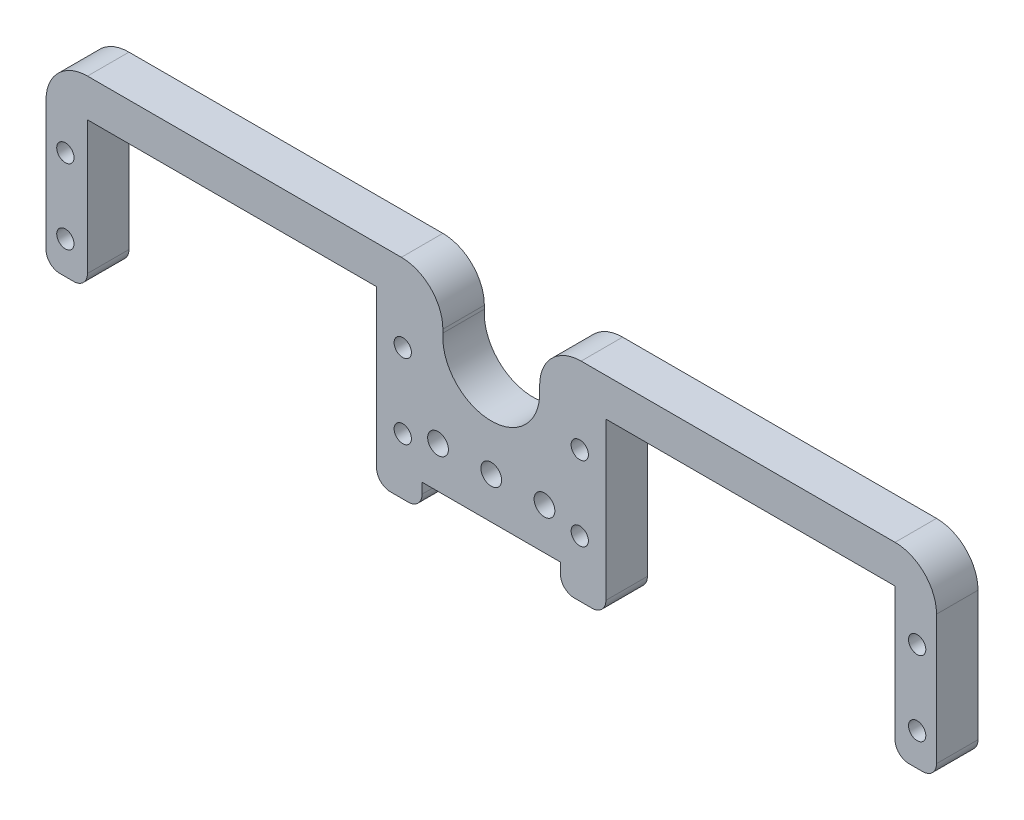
from build123d import *

# Parameters (mm, degrees)
SKETCH1_R           = 1.25
SKETCH1_R_2         = 1.5
BOSS_EXTRUDE1_DEPTH = 6


with BuildPart() as part:
    # Sketch1 → Boss-Extrude1 (new body)
    with BuildSketch(Plane.XY):
        with BuildLine():
            Line((164.942156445, 12.645422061), (166.942156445, 12.645422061))
            ThreePointArc((166.942156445, 12.645422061), (168.356370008, 13.231208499), (168.942156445, 14.645422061))
            Line((168.942156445, 14.645422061), (168.942156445, 32.895422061))
            Line((168.942156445, 32.895422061), (168.942156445, 33.895422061))
            Line((168.942156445, 33.895422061), (210.755943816, 33.895422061))
            Line((210.755943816, 33.895422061), (210.755943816, 11.198580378))
            ThreePointArc((210.755943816, 11.198580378), (211.341730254, 9.784366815), (212.755943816, 9.198580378))
            Line((212.755943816, 9.198580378), (215.342156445, 9.198580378))
            ThreePointArc((215.342156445, 9.198580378), (216.756370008, 9.784366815), (217.342156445, 11.198580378))
            Line((217.342156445, 11.198580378), (217.342156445, 12.698580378))
            Line((217.342156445, 12.698580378), (237.342156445, 12.698580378))
            Line((237.342156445, 12.698580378), (237.342156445, 11.198580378))
            ThreePointArc((237.342156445, 11.198580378), (237.927942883, 9.784366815), (239.342156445, 9.198580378))
            Line((239.342156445, 9.198580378), (241.928369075, 9.198580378))
            ThreePointArc((241.928369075, 9.198580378), (243.342582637, 9.784366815), (243.928369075, 11.198580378))
            Line((243.928369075, 11.198580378), (243.928369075, 33.895422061))
            Line((243.928369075, 33.895422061), (285.742156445, 33.895422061))
            Line((285.742156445, 33.895422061), (285.742156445, 32.895422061))
            Line((285.742156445, 32.895422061), (285.742156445, 14.645422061))
            ThreePointArc((285.742156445, 14.645422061), (286.327942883, 13.231208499), (287.742156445, 12.645422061))
            Line((287.742156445, 12.645422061), (289.742156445, 12.645422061))
            ThreePointArc((289.742156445, 12.645422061), (291.156370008, 13.231208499), (291.742156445, 14.645422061))
            Line((291.742156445, 14.645422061), (291.742156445, 33.370475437))
            ThreePointArc((291.742156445, 33.370475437), (289.984797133, 37.613116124), (285.742156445, 39.370475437))
            Line((285.742156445, 39.370475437), (240.342156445, 39.370475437))
            ThreePointArc((240.342156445, 39.370475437), (236.099515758, 37.613116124), (234.342156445, 33.370475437))
            Line((234.342156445, 33.370475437), (234.342156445, 32.873764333))
            ThreePointArc((234.342156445, 32.873764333), (227.342156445, 25.370475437), (220.342156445, 32.873764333))
            Line((220.342156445, 32.873764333), (220.342156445, 33.370475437))
            ThreePointArc((220.342156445, 33.370475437), (218.584797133, 37.613116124), (214.342156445, 39.370475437))
            Line((214.342156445, 39.370475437), (168.942156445, 39.370475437))
            ThreePointArc((168.942156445, 39.370475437), (164.699515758, 37.613116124), (162.942156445, 33.370475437))
            Line((162.942156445, 33.370475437), (162.942156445, 14.645422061))
            ThreePointArc((162.942156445, 14.645422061), (163.527942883, 13.231208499), (164.942156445, 12.645422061))
        make_face()
        with Locations((214.542156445, 17.375422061)):
            Circle(SKETCH1_R, mode=Mode.SUBTRACT)
        with Locations((214.542156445, 28.165422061)):
            Circle(SKETCH1_R, mode=Mode.SUBTRACT)
        with Locations((165.742156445, 28.165422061)):
            Circle(SKETCH1_R, mode=Mode.SUBTRACT)
        with Locations((165.742156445, 17.375422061)):
            Circle(SKETCH1_R, mode=Mode.SUBTRACT)
        with Locations((219.644215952, 18.698580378)):
            Circle(SKETCH1_R_2, mode=Mode.SUBTRACT)
        with Locations((227.342156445, 18.698580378)):
            Circle(SKETCH1_R_2, mode=Mode.SUBTRACT)
        with Locations((235.040096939, 18.698580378)):
            Circle(SKETCH1_R_2, mode=Mode.SUBTRACT)
        with Locations(Location((240.142156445, 17.375422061, 0), (0, 0, 180))):
            Circle(SKETCH1_R, mode=Mode.SUBTRACT)
        with Locations(Location((240.142156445, 28.165422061, 0), (0, 0, 180))):
            Circle(SKETCH1_R, mode=Mode.SUBTRACT)
        with Locations(Location((288.942156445, 17.375422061, 0), (0, 0, 180))):
            Circle(SKETCH1_R, mode=Mode.SUBTRACT)
        with Locations(Location((288.942156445, 28.165422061, 0), (0, 0, 180))):
            Circle(SKETCH1_R, mode=Mode.SUBTRACT)
    extrude(amount=BOSS_EXTRUDE1_DEPTH)


solid = part.part
